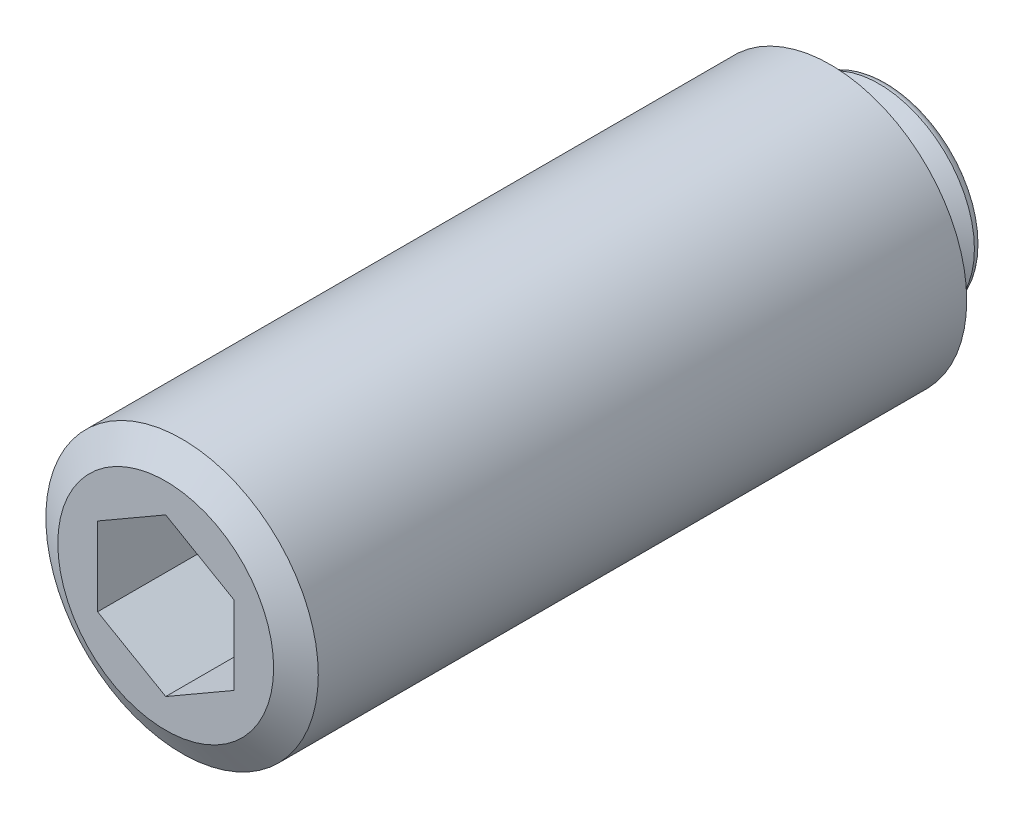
ISO-10303-21;
HEADER;
FILE_DESCRIPTION(('STEP AP214'),'2;1');
FILE_NAME('part.step','',(''),(''),'','','');
FILE_SCHEMA(('AUTOMOTIVE_DESIGN { 1 0 10303 214 1 1 1 1 }'));
ENDSEC;
DATA;
#1=APPLICATION_CONTEXT('core data for automotive mechanical design processes');
#2=APPLICATION_PROTOCOL_DEFINITION('international standard','automotive_design',2000,#1);
#3=PRODUCT_CONTEXT('',#1,'mechanical');
#4=PRODUCT('Part','Part','',(#3));
#5=PRODUCT_RELATED_PRODUCT_CATEGORY('part','',(#4));
#6=PRODUCT_DEFINITION_FORMATION('','',#4);
#7=PRODUCT_DEFINITION_CONTEXT('part definition',#1,'design');
#8=PRODUCT_DEFINITION('design','',#6,#7);
#9=PRODUCT_DEFINITION_SHAPE('','',#8);
#10=(LENGTH_UNIT() NAMED_UNIT(*) SI_UNIT(.MILLI.,.METRE.));
#11=(NAMED_UNIT(*) PLANE_ANGLE_UNIT() SI_UNIT($,.RADIAN.));
#12=(NAMED_UNIT(*) SI_UNIT($,.STERADIAN.) SOLID_ANGLE_UNIT());
#13=UNCERTAINTY_MEASURE_WITH_UNIT(LENGTH_MEASURE(1.E-05),#10,'distance_accuracy_value','');
#14=(GEOMETRIC_REPRESENTATION_CONTEXT(3) GLOBAL_UNCERTAINTY_ASSIGNED_CONTEXT((#13)) GLOBAL_UNIT_ASSIGNED_CONTEXT((#10,
#11,#12)) REPRESENTATION_CONTEXT('',''));
#15=CARTESIAN_POINT('',(0.,0.,0.));
#16=DIRECTION('',(0.,0.,1.));
#17=DIRECTION('',(1.,0.,0.));
#18=AXIS2_PLACEMENT_3D('',#15,#16,#17);
#19=CARTESIAN_POINT('',(0.,0.,53.0000000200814));
#20=DIRECTION('',(0.,0.,1.));
#21=DIRECTION('',(1.,0.,0.));
#22=AXIS2_PLACEMENT_3D('',#19,#20,#21);
#23=PLANE('',#22);
#24=DIRECTION('',(-0.866025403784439,0.5,0.));
#25=VECTOR('',#24,1.);
#26=CARTESIAN_POINT('',(5.,2.88675134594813,53.0000000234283));
#27=LINE('',#26,#25);
#28=CARTESIAN_POINT('',(5.,2.88675134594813,53.0000000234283));
#29=VERTEX_POINT('',#28);
#30=CARTESIAN_POINT('',(0.,5.77350269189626,53.0000000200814));
#31=VERTEX_POINT('',#30);
#32=EDGE_CURVE('E28',#29,#31,#27,.T.);
#33=ORIENTED_EDGE('',*,*,#32,.F.);
#34=DIRECTION('',(0.,1.,0.));
#35=VECTOR('',#34,1.);
#36=CARTESIAN_POINT('',(5.,-2.88675134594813,53.0000000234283));
#37=LINE('',#36,#35);
#38=CARTESIAN_POINT('',(5.,-2.88675134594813,53.0000000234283));
#39=VERTEX_POINT('',#38);
#40=EDGE_CURVE('E111',#39,#29,#37,.T.);
#41=ORIENTED_EDGE('',*,*,#40,.F.);
#42=DIRECTION('',(0.866025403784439,0.5,0.));
#43=VECTOR('',#42,1.);
#44=CARTESIAN_POINT('',(0.,-5.77350269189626,53.0000000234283));
#45=LINE('',#44,#43);
#46=CARTESIAN_POINT('',(0.,-5.77350269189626,53.0000000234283));
#47=VERTEX_POINT('',#46);
#48=EDGE_CURVE('E109',#47,#39,#45,.T.);
#49=ORIENTED_EDGE('',*,*,#48,.F.);
#50=DIRECTION('',(0.866025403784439,-0.5,0.));
#51=VECTOR('',#50,1.);
#52=CARTESIAN_POINT('',(-5.,-2.88675134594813,53.0000000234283));
#53=LINE('',#52,#51);
#54=CARTESIAN_POINT('',(-5.,-2.88675134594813,53.0000000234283));
#55=VERTEX_POINT('',#54);
#56=EDGE_CURVE('E76',#55,#47,#53,.T.);
#57=ORIENTED_EDGE('',*,*,#56,.F.);
#58=DIRECTION('',(0.,-1.,0.));
#59=VECTOR('',#58,1.);
#60=CARTESIAN_POINT('',(-5.,2.88675134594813,53.0000000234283));
#61=LINE('',#60,#59);
#62=CARTESIAN_POINT('',(-5.,2.88675134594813,53.0000000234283));
#63=VERTEX_POINT('',#62);
#64=EDGE_CURVE('E105',#63,#55,#61,.T.);
#65=ORIENTED_EDGE('',*,*,#64,.F.);
#66=DIRECTION('',(-0.866025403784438,-0.5,0.));
#67=VECTOR('',#66,1.);
#68=CARTESIAN_POINT('',(0.,5.77350269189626,53.0000000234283));
#69=LINE('',#68,#67);
#70=EDGE_CURVE('E102',#31,#63,#69,.T.);
#71=ORIENTED_EDGE('',*,*,#70,.F.);
#72=EDGE_LOOP('',(#33,#41,#49,#57,#65,#71));
#73=FACE_BOUND('',#72,.T.);
#74=CARTESIAN_POINT('',(0.,0.,53.0000000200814));
#75=DIRECTION('',(0.,0.,1.));
#76=DIRECTION('',(1.,0.,0.));
#77=AXIS2_PLACEMENT_3D('',#74,#75,#76);
#78=CIRCLE('',#77,7.92153900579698);
#79=CARTESIAN_POINT('',(7.92153900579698,0.,53.0000000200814));
#80=VERTEX_POINT('',#79);
#81=EDGE_CURVE('E9',#80,#80,#78,.T.);
#82=ORIENTED_EDGE('',*,*,#81,.T.);
#83=EDGE_LOOP('',(#82));
#84=FACE_BOUND('',#83,.T.);
#85=ADVANCED_FACE('F14',(#73,#84),#23,.T.);
#86=CARTESIAN_POINT('',(0.,0.,53.0000000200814));
#87=DIRECTION('',(0.,0.,-1.));
#88=DIRECTION('',(-1.,0.,0.));
#89=AXIS2_PLACEMENT_3D('',#86,#87,#88);
#90=CONICAL_SURFACE('',#89,7.92153900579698,1.0471975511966);
#91=CARTESIAN_POINT('',(0.,0.,51.8000000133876));
#92=DIRECTION('',(0.,0.,1.));
#93=DIRECTION('',(1.,0.,0.));
#94=AXIS2_PLACEMENT_3D('',#91,#92,#93);
#95=CIRCLE('',#94,9.99999998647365);
#96=CARTESIAN_POINT('',(9.99999998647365,0.,51.8000000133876));
#97=VERTEX_POINT('',#96);
#98=EDGE_CURVE('E21',#97,#97,#95,.T.);
#99=ORIENTED_EDGE('',*,*,#98,.T.);
#100=EDGE_LOOP('',(#99));
#101=FACE_BOUND('',#100,.T.);
#102=ORIENTED_EDGE('',*,*,#81,.F.);
#103=EDGE_LOOP('',(#102));
#104=FACE_BOUND('',#103,.T.);
#105=ADVANCED_FACE('F149',(#101,#104),#90,.T.);
#106=CARTESIAN_POINT('',(0.,0.,55.9999999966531));
#107=DIRECTION('',(0.,0.,1.));
#108=DIRECTION('',(1.,0.,0.));
#109=AXIS2_PLACEMENT_3D('',#106,#107,#108);
#110=CYLINDRICAL_SURFACE('',#109,9.99999998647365);
#111=CARTESIAN_POINT('',(0.,0.,4.2000000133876));
#112=DIRECTION('',(0.,0.,1.));
#113=DIRECTION('',(1.,0.,0.));
#114=AXIS2_PLACEMENT_3D('',#111,#112,#113);
#115=CIRCLE('',#114,9.99999998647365);
#116=CARTESIAN_POINT('',(9.99999998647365,0.,4.2000000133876));
#117=VERTEX_POINT('',#116);
#118=EDGE_CURVE('E144',#117,#117,#115,.T.);
#119=ORIENTED_EDGE('',*,*,#118,.T.);
#120=EDGE_LOOP('',(#119));
#121=FACE_BOUND('',#120,.T.);
#122=ORIENTED_EDGE('',*,*,#98,.F.);
#123=EDGE_LOOP('',(#122));
#124=FACE_BOUND('',#123,.T.);
#125=ADVANCED_FACE('F152',(#121,#124),#110,.T.);
#126=CARTESIAN_POINT('',(0.,0.,4.2000000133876));
#127=DIRECTION('',(0.,0.,1.));
#128=DIRECTION('',(1.,0.,0.));
#129=AXIS2_PLACEMENT_3D('',#126,#127,#128);
#130=CONICAL_SURFACE('',#129,9.99999998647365,1.0471975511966);
#131=CARTESIAN_POINT('',(0.,0.,3.));
#132=DIRECTION('',(0.,0.,1.));
#133=DIRECTION('',(1.,0.,0.));
#134=AXIS2_PLACEMENT_3D('',#131,#132,#133);
#135=CIRCLE('',#134,7.92153899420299);
#136=CARTESIAN_POINT('',(7.92153899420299,0.,3.));
#137=VERTEX_POINT('',#136);
#138=EDGE_CURVE('E141',#137,#137,#135,.T.);
#139=ORIENTED_EDGE('',*,*,#138,.T.);
#140=EDGE_LOOP('',(#139));
#141=FACE_BOUND('',#140,.T.);
#142=ORIENTED_EDGE('',*,*,#118,.F.);
#143=EDGE_LOOP('',(#142));
#144=FACE_BOUND('',#143,.T.);
#145=ADVANCED_FACE('F154',(#141,#144),#130,.T.);
#146=CARTESIAN_POINT('',(0.,5.56999083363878,3.));
#147=DIRECTION('',(0.,0.,-1.));
#148=DIRECTION('',(-1.,0.,0.));
#149=AXIS2_PLACEMENT_3D('',#146,#147,#148);
#150=PLANE('',#149);
#151=CARTESIAN_POINT('',(0.,0.,3.));
#152=DIRECTION('',(0.,0.,1.));
#153=DIRECTION('',(1.,0.,0.));
#154=AXIS2_PLACEMENT_3D('',#151,#152,#153);
#155=CIRCLE('',#154,5.56999083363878);
#156=CARTESIAN_POINT('',(5.56999083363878,0.,3.));
#157=VERTEX_POINT('',#156);
#158=EDGE_CURVE('E138',#157,#157,#155,.T.);
#159=ORIENTED_EDGE('',*,*,#158,.T.);
#160=EDGE_LOOP('',(#159));
#161=FACE_BOUND('',#160,.T.);
#162=ORIENTED_EDGE('',*,*,#138,.F.);
#163=EDGE_LOOP('',(#162));
#164=FACE_BOUND('',#163,.T.);
#165=ADVANCED_FACE('F163',(#161,#164),#150,.T.);
#166=CARTESIAN_POINT('',(0.,0.,3.));
#167=DIRECTION('',(0.,0.,1.));
#168=DIRECTION('',(1.,0.,0.));
#169=AXIS2_PLACEMENT_3D('',#166,#167,#168);
#170=CONICAL_SURFACE('',#169,5.56999083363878,0.551775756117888);
#171=CARTESIAN_POINT('',(0.,0.,2.8864159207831));
#172=DIRECTION('',(0.,0.,1.));
#173=DIRECTION('',(1.,0.,0.));
#174=AXIS2_PLACEMENT_3D('',#171,#172,#173);
#175=CIRCLE('',#174,5.50007402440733);
#176=CARTESIAN_POINT('',(5.50007402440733,0.,2.8864159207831));
#177=VERTEX_POINT('',#176);
#178=EDGE_CURVE('E135',#177,#177,#175,.T.);
#179=ORIENTED_EDGE('',*,*,#178,.T.);
#180=EDGE_LOOP('',(#179));
#181=FACE_BOUND('',#180,.T.);
#182=ORIENTED_EDGE('',*,*,#158,.F.);
#183=EDGE_LOOP('',(#182));
#184=FACE_BOUND('',#183,.T.);
#185=ADVANCED_FACE('F214',(#181,#184),#170,.T.);
#186=CARTESIAN_POINT('',(0.,0.,2.7510540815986));
#187=DIRECTION('',(0.,0.,1.));
#188=DIRECTION('',(1.,0.,0.));
#189=AXIS2_PLACEMENT_3D('',#186,#187,#188);
#190=TOROIDAL_SURFACE('',#189,5.71499999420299,0.254000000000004);
#191=CARTESIAN_POINT('',(0.,0.,2.7510540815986));
#192=DIRECTION('',(0.,0.,1.));
#193=DIRECTION('',(1.,0.,0.));
#194=AXIS2_PLACEMENT_3D('',#191,#192,#193);
#195=CIRCLE('',#194,5.460999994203);
#196=CARTESIAN_POINT('',(5.460999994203,0.,2.7510540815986));
#197=VERTEX_POINT('',#196);
#198=EDGE_CURVE('E132',#197,#197,#195,.T.);
#199=ORIENTED_EDGE('',*,*,#198,.T.);
#200=EDGE_LOOP('',(#199));
#201=FACE_BOUND('',#200,.T.);
#202=ORIENTED_EDGE('',*,*,#178,.F.);
#203=EDGE_LOOP('',(#202));
#204=FACE_BOUND('',#203,.T.);
#205=ADVANCED_FACE('F210',(#201,#204),#190,.F.);
#206=CARTESIAN_POINT('',(0.,0.,55.9999999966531));
#207=DIRECTION('',(0.,0.,1.));
#208=DIRECTION('',(1.,0.,0.));
#209=AXIS2_PLACEMENT_3D('',#206,#207,#208);
#210=CYLINDRICAL_SURFACE('',#209,5.46099999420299);
#211=CARTESIAN_POINT('',(0.,0.,1.67018903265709));
#212=DIRECTION('',(0.,0.,1.));
#213=DIRECTION('',(1.,0.,0.));
#214=AXIS2_PLACEMENT_3D('',#211,#212,#213);
#215=CIRCLE('',#214,5.46099999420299);
#216=CARTESIAN_POINT('',(5.46099999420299,0.,1.67018903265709));
#217=VERTEX_POINT('',#216);
#218=EDGE_CURVE('E129',#217,#217,#215,.T.);
#219=ORIENTED_EDGE('',*,*,#218,.T.);
#220=EDGE_LOOP('',(#219));
#221=FACE_BOUND('',#220,.T.);
#222=ORIENTED_EDGE('',*,*,#198,.F.);
#223=EDGE_LOOP('',(#222));
#224=FACE_BOUND('',#223,.T.);
#225=ADVANCED_FACE('F206',(#221,#224),#210,.T.);
#226=CARTESIAN_POINT('',(0.,0.,1.67018903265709));
#227=DIRECTION('',(0.,0.,1.));
#228=DIRECTION('',(1.,0.,0.));
#229=AXIS2_PLACEMENT_3D('',#226,#227,#228);
#230=TOROIDAL_SURFACE('',#229,5.71499999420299,0.254000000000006);
#231=CARTESIAN_POINT('',(0.,0.,1.4502185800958));
#232=DIRECTION('',(0.,0.,1.));
#233=DIRECTION('',(1.,0.,0.));
#234=AXIS2_PLACEMENT_3D('',#231,#232,#233);
#235=CIRCLE('',#234,5.58799999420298);
#236=CARTESIAN_POINT('',(5.58799999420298,0.,1.4502185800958));
#237=VERTEX_POINT('',#236);
#238=EDGE_CURVE('E126',#237,#237,#235,.T.);
#239=ORIENTED_EDGE('',*,*,#238,.T.);
#240=EDGE_LOOP('',(#239));
#241=FACE_BOUND('',#240,.T.);
#242=ORIENTED_EDGE('',*,*,#218,.F.);
#243=EDGE_LOOP('',(#242));
#244=FACE_BOUND('',#243,.T.);
#245=ADVANCED_FACE('F202',(#241,#244),#230,.F.);
#246=CARTESIAN_POINT('',(0.,0.,1.4502185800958));
#247=DIRECTION('',(0.,0.,-1.));
#248=DIRECTION('',(-1.,0.,0.));
#249=AXIS2_PLACEMENT_3D('',#246,#247,#248);
#250=CONICAL_SURFACE('',#249,5.58799999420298,1.04719755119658);
#251=CARTESIAN_POINT('',(0.,0.,0.635));
#252=DIRECTION('',(0.,0.,1.));
#253=DIRECTION('',(1.,0.,0.));
#254=AXIS2_PLACEMENT_3D('',#251,#252,#253);
#255=CIRCLE('',#254,6.99999999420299);
#256=CARTESIAN_POINT('',(6.99999999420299,0.,0.635));
#257=VERTEX_POINT('',#256);
#258=EDGE_CURVE('E123',#257,#257,#255,.T.);
#259=ORIENTED_EDGE('',*,*,#258,.T.);
#260=EDGE_LOOP('',(#259));
#261=FACE_BOUND('',#260,.T.);
#262=ORIENTED_EDGE('',*,*,#238,.F.);
#263=EDGE_LOOP('',(#262));
#264=FACE_BOUND('',#263,.T.);
#265=ADVANCED_FACE('F198',(#261,#264),#250,.T.);
#266=CARTESIAN_POINT('',(0.,0.,0.635));
#267=DIRECTION('',(0.,0.,1.));
#268=DIRECTION('',(1.,0.,0.));
#269=AXIS2_PLACEMENT_3D('',#266,#267,#268);
#270=TOROIDAL_SURFACE('',#269,6.36499999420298,0.635000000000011);
#271=CARTESIAN_POINT('',(0.,0.,0.));
#272=DIRECTION('',(0.,0.,1.));
#273=DIRECTION('',(1.,0.,0.));
#274=AXIS2_PLACEMENT_3D('',#271,#272,#273);
#275=CIRCLE('',#274,6.36500000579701);
#276=CARTESIAN_POINT('',(6.36500000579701,0.,0.));
#277=VERTEX_POINT('',#276);
#278=EDGE_CURVE('E115',#277,#277,#275,.T.);
#279=ORIENTED_EDGE('',*,*,#278,.T.);
#280=EDGE_LOOP('',(#279));
#281=FACE_BOUND('',#280,.T.);
#282=ORIENTED_EDGE('',*,*,#258,.F.);
#283=EDGE_LOOP('',(#282));
#284=FACE_BOUND('',#283,.T.);
#285=ADVANCED_FACE('F190',(#281,#284),#270,.T.);
#286=CARTESIAN_POINT('',(0.,0.,0.));
#287=DIRECTION('',(0.,0.,-1.));
#288=DIRECTION('',(-1.,0.,0.));
#289=AXIS2_PLACEMENT_3D('',#286,#287,#288);
#290=PLANE('',#289);
#291=ORIENTED_EDGE('',*,*,#278,.F.);
#292=EDGE_LOOP('',(#291));
#293=FACE_BOUND('',#292,.T.);
#294=ADVANCED_FACE('F182',(#293),#290,.T.);
#295=CARTESIAN_POINT('',(5.,2.88675134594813,45.0000000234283));
#296=DIRECTION('',(0.5,0.866025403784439,0.));
#297=DIRECTION('',(0.866025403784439,-0.5,0.));
#298=AXIS2_PLACEMENT_3D('',#295,#296,#297);
#299=PLANE('',#298);
#300=ORIENTED_EDGE('',*,*,#32,.T.);
#301=DIRECTION('',(0.,0.,1.));
#302=VECTOR('',#301,1.);
#303=CARTESIAN_POINT('',(0.,5.77350269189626,45.0000000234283));
#304=LINE('',#303,#302);
#305=CARTESIAN_POINT('',(0.,5.77350269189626,45.0000000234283));
#306=VERTEX_POINT('',#305);
#307=EDGE_CURVE('E58',#306,#31,#304,.T.);
#308=ORIENTED_EDGE('',*,*,#307,.F.);
#309=DIRECTION('',(-0.866025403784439,0.5,0.));
#310=VECTOR('',#309,1.);
#311=CARTESIAN_POINT('',(5.,2.88675134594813,45.0000000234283));
#312=LINE('',#311,#310);
#313=CARTESIAN_POINT('',(5.,2.88675134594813,45.0000000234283));
#314=VERTEX_POINT('',#313);
#315=EDGE_CURVE('E113',#314,#306,#312,.T.);
#316=ORIENTED_EDGE('',*,*,#315,.F.);
#317=DIRECTION('',(0.,0.,1.));
#318=VECTOR('',#317,1.);
#319=CARTESIAN_POINT('',(5.,2.88675134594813,45.0000000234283));
#320=LINE('',#319,#318);
#321=EDGE_CURVE('E36',#314,#29,#320,.T.);
#322=ORIENTED_EDGE('',*,*,#321,.T.);
#323=EDGE_LOOP('',(#300,#308,#316,#322));
#324=FACE_BOUND('',#323,.T.);
#325=ADVANCED_FACE('F179',(#324),#299,.F.);
#326=CARTESIAN_POINT('',(5.,-2.88675134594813,45.0000000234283));
#327=DIRECTION('',(1.,0.,0.));
#328=DIRECTION('',(0.,0.,-1.));
#329=AXIS2_PLACEMENT_3D('',#326,#327,#328);
#330=PLANE('',#329);
#331=ORIENTED_EDGE('',*,*,#40,.T.);
#332=ORIENTED_EDGE('',*,*,#321,.F.);
#333=DIRECTION('',(0.,1.,0.));
#334=VECTOR('',#333,1.);
#335=CARTESIAN_POINT('',(5.,-2.88675134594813,45.0000000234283));
#336=LINE('',#335,#334);
#337=CARTESIAN_POINT('',(5.,-2.88675134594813,45.0000000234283));
#338=VERTEX_POINT('',#337);
#339=EDGE_CURVE('E88',#338,#314,#336,.T.);
#340=ORIENTED_EDGE('',*,*,#339,.F.);
#341=DIRECTION('',(0.,0.,1.));
#342=VECTOR('',#341,1.);
#343=CARTESIAN_POINT('',(5.,-2.88675134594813,45.0000000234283));
#344=LINE('',#343,#342);
#345=EDGE_CURVE('E80',#338,#39,#344,.T.);
#346=ORIENTED_EDGE('',*,*,#345,.T.);
#347=EDGE_LOOP('',(#331,#332,#340,#346));
#348=FACE_BOUND('',#347,.T.);
#349=ADVANCED_FACE('F181',(#348),#330,.F.);
#350=CARTESIAN_POINT('',(0.,-5.77350269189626,45.0000000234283));
#351=DIRECTION('',(0.5,-0.866025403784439,0.));
#352=DIRECTION('',(-0.866025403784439,-0.5,0.));
#353=AXIS2_PLACEMENT_3D('',#350,#351,#352);
#354=PLANE('',#353);
#355=ORIENTED_EDGE('',*,*,#48,.T.);
#356=ORIENTED_EDGE('',*,*,#345,.F.);
#357=DIRECTION('',(0.866025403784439,0.5,0.));
#358=VECTOR('',#357,1.);
#359=CARTESIAN_POINT('',(0.,-5.77350269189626,45.0000000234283));
#360=LINE('',#359,#358);
#361=CARTESIAN_POINT('',(0.,-5.77350269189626,45.0000000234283));
#362=VERTEX_POINT('',#361);
#363=EDGE_CURVE('E84',#362,#338,#360,.T.);
#364=ORIENTED_EDGE('',*,*,#363,.F.);
#365=DIRECTION('',(0.,0.,1.));
#366=VECTOR('',#365,1.);
#367=CARTESIAN_POINT('',(0.,-5.77350269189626,45.0000000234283));
#368=LINE('',#367,#366);
#369=EDGE_CURVE('E69',#362,#47,#368,.T.);
#370=ORIENTED_EDGE('',*,*,#369,.T.);
#371=EDGE_LOOP('',(#355,#356,#364,#370));
#372=FACE_BOUND('',#371,.T.);
#373=ADVANCED_FACE('F85',(#372),#354,.F.);
#374=CARTESIAN_POINT('',(-5.,-2.88675134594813,45.0000000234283));
#375=DIRECTION('',(-0.5,-0.866025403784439,0.));
#376=DIRECTION('',(-0.866025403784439,0.5,0.));
#377=AXIS2_PLACEMENT_3D('',#374,#375,#376);
#378=PLANE('',#377);
#379=ORIENTED_EDGE('',*,*,#56,.T.);
#380=ORIENTED_EDGE('',*,*,#369,.F.);
#381=DIRECTION('',(0.866025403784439,-0.5,0.));
#382=VECTOR('',#381,1.);
#383=CARTESIAN_POINT('',(-5.,-2.88675134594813,45.0000000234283));
#384=LINE('',#383,#382);
#385=CARTESIAN_POINT('',(-5.,-2.88675134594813,45.0000000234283));
#386=VERTEX_POINT('',#385);
#387=EDGE_CURVE('E73',#386,#362,#384,.T.);
#388=ORIENTED_EDGE('',*,*,#387,.F.);
#389=DIRECTION('',(0.,0.,1.));
#390=VECTOR('',#389,1.);
#391=CARTESIAN_POINT('',(-5.,-2.88675134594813,45.0000000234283));
#392=LINE('',#391,#390);
#393=EDGE_CURVE('E81',#386,#55,#392,.T.);
#394=ORIENTED_EDGE('',*,*,#393,.T.);
#395=EDGE_LOOP('',(#379,#380,#388,#394));
#396=FACE_BOUND('',#395,.T.);
#397=ADVANCED_FACE('F71',(#396),#378,.F.);
#398=CARTESIAN_POINT('',(-5.,2.88675134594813,45.0000000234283));
#399=DIRECTION('',(-1.,0.,0.));
#400=DIRECTION('',(0.,0.,1.));
#401=AXIS2_PLACEMENT_3D('',#398,#399,#400);
#402=PLANE('',#401);
#403=ORIENTED_EDGE('',*,*,#64,.T.);
#404=ORIENTED_EDGE('',*,*,#393,.F.);
#405=DIRECTION('',(0.,-1.,0.));
#406=VECTOR('',#405,1.);
#407=CARTESIAN_POINT('',(-5.,2.88675134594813,45.0000000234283));
#408=LINE('',#407,#406);
#409=CARTESIAN_POINT('',(-5.,2.88675134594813,45.0000000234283));
#410=VERTEX_POINT('',#409);
#411=EDGE_CURVE('E94',#410,#386,#408,.T.);
#412=ORIENTED_EDGE('',*,*,#411,.F.);
#413=DIRECTION('',(0.,0.,1.));
#414=VECTOR('',#413,1.);
#415=CARTESIAN_POINT('',(-5.,2.88675134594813,45.0000000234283));
#416=LINE('',#415,#414);
#417=EDGE_CURVE('E118',#410,#63,#416,.T.);
#418=ORIENTED_EDGE('',*,*,#417,.T.);
#419=EDGE_LOOP('',(#403,#404,#412,#418));
#420=FACE_BOUND('',#419,.T.);
#421=ADVANCED_FACE('F321',(#420),#402,.F.);
#422=CARTESIAN_POINT('',(0.,5.77350269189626,45.0000000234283));
#423=DIRECTION('',(-0.5,0.866025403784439,0.));
#424=DIRECTION('',(0.866025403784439,0.5,0.));
#425=AXIS2_PLACEMENT_3D('',#422,#423,#424);
#426=PLANE('',#425);
#427=ORIENTED_EDGE('',*,*,#70,.T.);
#428=ORIENTED_EDGE('',*,*,#417,.F.);
#429=DIRECTION('',(-0.866025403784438,-0.5,0.));
#430=VECTOR('',#429,1.);
#431=CARTESIAN_POINT('',(0.,5.77350269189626,45.0000000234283));
#432=LINE('',#431,#430);
#433=EDGE_CURVE('E96',#306,#410,#432,.T.);
#434=ORIENTED_EDGE('',*,*,#433,.F.);
#435=ORIENTED_EDGE('',*,*,#307,.T.);
#436=EDGE_LOOP('',(#427,#428,#434,#435));
#437=FACE_BOUND('',#436,.T.);
#438=ADVANCED_FACE('F177',(#437),#426,.F.);
#439=CARTESIAN_POINT('',(0.,5.77350269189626,45.0000000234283));
#440=DIRECTION('',(0.,0.,1.));
#441=DIRECTION('',(1.,0.,0.));
#442=AXIS2_PLACEMENT_3D('',#439,#440,#441);
#443=PLANE('',#442);
#444=ORIENTED_EDGE('',*,*,#315,.T.);
#445=ORIENTED_EDGE('',*,*,#433,.T.);
#446=ORIENTED_EDGE('',*,*,#411,.T.);
#447=ORIENTED_EDGE('',*,*,#387,.T.);
#448=ORIENTED_EDGE('',*,*,#363,.T.);
#449=ORIENTED_EDGE('',*,*,#339,.T.);
#450=EDGE_LOOP('',(#444,#445,#446,#447,#448,#449));
#451=FACE_BOUND('',#450,.T.);
#452=ADVANCED_FACE('F91',(#451),#443,.T.);
#453=CLOSED_SHELL('',(#85,#105,#125,#145,#165,#185,#205,#225,#245,#265,#285,#294,#325,#349,#373,
#397,#421,#438,#452));
#454=MANIFOLD_SOLID_BREP('B1',#453);
#455=ADVANCED_BREP_SHAPE_REPRESENTATION('',(#18,#454),#14);
#456=SHAPE_DEFINITION_REPRESENTATION(#9,#455);
ENDSEC;
END-ISO-10303-21;
